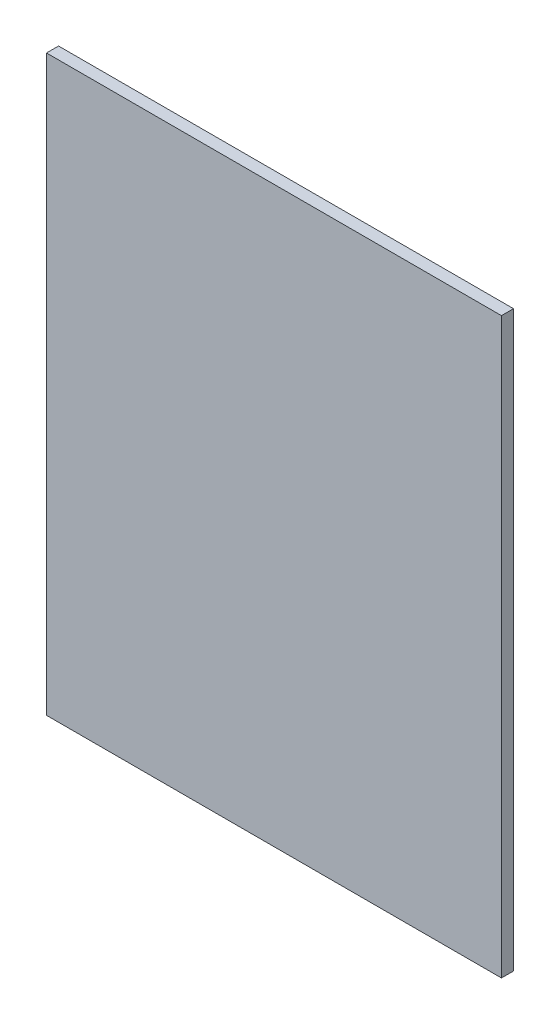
ISO-10303-21;
HEADER;
FILE_DESCRIPTION(('STEP AP214'),'2;1');
FILE_NAME('part.step','',(''),(''),'','','');
FILE_SCHEMA(('AUTOMOTIVE_DESIGN { 1 0 10303 214 1 1 1 1 }'));
ENDSEC;
DATA;
#1=APPLICATION_CONTEXT('core data for automotive mechanical design processes');
#2=APPLICATION_PROTOCOL_DEFINITION('international standard','automotive_design',2000,#1);
#3=PRODUCT_CONTEXT('',#1,'mechanical');
#4=PRODUCT('Part','Part','',(#3));
#5=PRODUCT_RELATED_PRODUCT_CATEGORY('part','',(#4));
#6=PRODUCT_DEFINITION_FORMATION('','',#4);
#7=PRODUCT_DEFINITION_CONTEXT('part definition',#1,'design');
#8=PRODUCT_DEFINITION('design','',#6,#7);
#9=PRODUCT_DEFINITION_SHAPE('','',#8);
#10=(LENGTH_UNIT() NAMED_UNIT(*) SI_UNIT(.MILLI.,.METRE.));
#11=(NAMED_UNIT(*) PLANE_ANGLE_UNIT() SI_UNIT($,.RADIAN.));
#12=(NAMED_UNIT(*) SI_UNIT($,.STERADIAN.) SOLID_ANGLE_UNIT());
#13=UNCERTAINTY_MEASURE_WITH_UNIT(LENGTH_MEASURE(1.E-05),#10,'distance_accuracy_value','');
#14=(GEOMETRIC_REPRESENTATION_CONTEXT(3) GLOBAL_UNCERTAINTY_ASSIGNED_CONTEXT((#13)) GLOBAL_UNIT_ASSIGNED_CONTEXT((#10,
#11,#12)) REPRESENTATION_CONTEXT('',''));
#15=CARTESIAN_POINT('',(0.,0.,0.));
#16=DIRECTION('',(0.,0.,1.));
#17=DIRECTION('',(1.,0.,0.));
#18=AXIS2_PLACEMENT_3D('',#15,#16,#17);
#19=CARTESIAN_POINT('',(6.225,21.225,-0.03048));
#20=DIRECTION('',(0.,-1.,0.));
#21=DIRECTION('',(0.,0.,-1.));
#22=AXIS2_PLACEMENT_3D('',#19,#20,#21);
#23=PLANE('',#22);
#24=DIRECTION('',(1.,0.,0.));
#25=VECTOR('',#24,1.);
#26=CARTESIAN_POINT('',(6.8,21.225,0.));
#27=LINE('',#26,#25);
#28=CARTESIAN_POINT('',(6.225,21.225,0.));
#29=VERTEX_POINT('',#28);
#30=CARTESIAN_POINT('',(7.375,21.225,0.));
#31=VERTEX_POINT('',#30);
#32=EDGE_CURVE('E75',#29,#31,#27,.T.);
#33=ORIENTED_EDGE('',*,*,#32,.T.);
#34=DIRECTION('',(0.,0.,-1.));
#35=VECTOR('',#34,1.);
#36=CARTESIAN_POINT('',(7.375,21.225,-0.01524));
#37=LINE('',#36,#35);
#38=CARTESIAN_POINT('',(7.375,21.225,-0.03048));
#39=VERTEX_POINT('',#38);
#40=EDGE_CURVE('E20',#31,#39,#37,.T.);
#41=ORIENTED_EDGE('',*,*,#40,.T.);
#42=DIRECTION('',(1.,0.,0.));
#43=VECTOR('',#42,1.);
#44=CARTESIAN_POINT('',(6.225,21.225,-0.03048));
#45=LINE('',#44,#43);
#46=CARTESIAN_POINT('',(6.225,21.225,-0.03048));
#47=VERTEX_POINT('',#46);
#48=EDGE_CURVE('E77',#47,#39,#45,.T.);
#49=ORIENTED_EDGE('',*,*,#48,.F.);
#50=DIRECTION('',(0.,0.,-1.));
#51=VECTOR('',#50,1.);
#52=CARTESIAN_POINT('',(6.225,21.225,-0.01524));
#53=LINE('',#52,#51);
#54=EDGE_CURVE('E11',#29,#47,#53,.T.);
#55=ORIENTED_EDGE('',*,*,#54,.F.);
#56=EDGE_LOOP('',(#33,#41,#49,#55));
#57=FACE_BOUND('',#56,.T.);
#58=ADVANCED_FACE('F17',(#57),#23,.F.);
#59=CARTESIAN_POINT('',(6.225,19.775,-0.03048));
#60=DIRECTION('',(1.,0.,0.));
#61=DIRECTION('',(0.,1.,0.));
#62=AXIS2_PLACEMENT_3D('',#59,#60,#61);
#63=PLANE('',#62);
#64=DIRECTION('',(0.,1.,0.));
#65=VECTOR('',#64,1.);
#66=CARTESIAN_POINT('',(6.225,20.5,0.));
#67=LINE('',#66,#65);
#68=CARTESIAN_POINT('',(6.225,19.775,0.));
#69=VERTEX_POINT('',#68);
#70=EDGE_CURVE('E81',#69,#29,#67,.T.);
#71=ORIENTED_EDGE('',*,*,#70,.T.);
#72=ORIENTED_EDGE('',*,*,#54,.T.);
#73=DIRECTION('',(0.,1.,0.));
#74=VECTOR('',#73,1.);
#75=CARTESIAN_POINT('',(6.225,19.775,-0.03048));
#76=LINE('',#75,#74);
#77=CARTESIAN_POINT('',(6.225,19.775,-0.03048));
#78=VERTEX_POINT('',#77);
#79=EDGE_CURVE('E109',#78,#47,#76,.T.);
#80=ORIENTED_EDGE('',*,*,#79,.F.);
#81=DIRECTION('',(0.,0.,-1.));
#82=VECTOR('',#81,1.);
#83=CARTESIAN_POINT('',(6.225,19.775,-0.01524));
#84=LINE('',#83,#82);
#85=EDGE_CURVE('E26',#69,#78,#84,.T.);
#86=ORIENTED_EDGE('',*,*,#85,.F.);
#87=EDGE_LOOP('',(#71,#72,#80,#86));
#88=FACE_BOUND('',#87,.T.);
#89=ADVANCED_FACE('F82',(#88),#63,.F.);
#90=CARTESIAN_POINT('',(7.375,19.775,-0.03048));
#91=DIRECTION('',(0.,1.,0.));
#92=DIRECTION('',(1.,0.,0.));
#93=AXIS2_PLACEMENT_3D('',#90,#91,#92);
#94=PLANE('',#93);
#95=DIRECTION('',(-1.,0.,0.));
#96=VECTOR('',#95,1.);
#97=CARTESIAN_POINT('',(6.8,19.775,0.));
#98=LINE('',#97,#96);
#99=CARTESIAN_POINT('',(7.375,19.775,0.));
#100=VERTEX_POINT('',#99);
#101=EDGE_CURVE('E86',#100,#69,#98,.T.);
#102=ORIENTED_EDGE('',*,*,#101,.T.);
#103=ORIENTED_EDGE('',*,*,#85,.T.);
#104=DIRECTION('',(-1.,0.,0.));
#105=VECTOR('',#104,1.);
#106=CARTESIAN_POINT('',(7.375,19.775,-0.03048));
#107=LINE('',#106,#105);
#108=CARTESIAN_POINT('',(7.375,19.775,-0.03048));
#109=VERTEX_POINT('',#108);
#110=EDGE_CURVE('E105',#109,#78,#107,.T.);
#111=ORIENTED_EDGE('',*,*,#110,.F.);
#112=DIRECTION('',(0.,0.,-1.));
#113=VECTOR('',#112,1.);
#114=CARTESIAN_POINT('',(7.375,19.775,-0.01524));
#115=LINE('',#114,#113);
#116=EDGE_CURVE('E48',#100,#109,#115,.T.);
#117=ORIENTED_EDGE('',*,*,#116,.F.);
#118=EDGE_LOOP('',(#102,#103,#111,#117));
#119=FACE_BOUND('',#118,.T.);
#120=ADVANCED_FACE('F121',(#119),#94,.F.);
#121=CARTESIAN_POINT('',(7.375,21.225,-0.03048));
#122=DIRECTION('',(-1.,0.,0.));
#123=DIRECTION('',(0.,0.,1.));
#124=AXIS2_PLACEMENT_3D('',#121,#122,#123);
#125=PLANE('',#124);
#126=DIRECTION('',(0.,-1.,0.));
#127=VECTOR('',#126,1.);
#128=CARTESIAN_POINT('',(7.375,20.5,0.));
#129=LINE('',#128,#127);
#130=EDGE_CURVE('E90',#31,#100,#129,.T.);
#131=ORIENTED_EDGE('',*,*,#130,.T.);
#132=ORIENTED_EDGE('',*,*,#116,.T.);
#133=DIRECTION('',(0.,-1.,0.));
#134=VECTOR('',#133,1.);
#135=CARTESIAN_POINT('',(7.375,21.225,-0.03048));
#136=LINE('',#135,#134);
#137=EDGE_CURVE('E99',#39,#109,#136,.T.);
#138=ORIENTED_EDGE('',*,*,#137,.F.);
#139=ORIENTED_EDGE('',*,*,#40,.F.);
#140=EDGE_LOOP('',(#131,#132,#138,#139));
#141=FACE_BOUND('',#140,.T.);
#142=ADVANCED_FACE('F118',(#141),#125,.F.);
#143=CARTESIAN_POINT('',(6.8,20.5,-0.03048));
#144=DIRECTION('',(0.,0.,1.));
#145=DIRECTION('',(1.,0.,0.));
#146=AXIS2_PLACEMENT_3D('',#143,#144,#145);
#147=PLANE('',#146);
#148=ORIENTED_EDGE('',*,*,#48,.T.);
#149=ORIENTED_EDGE('',*,*,#137,.T.);
#150=ORIENTED_EDGE('',*,*,#110,.T.);
#151=ORIENTED_EDGE('',*,*,#79,.T.);
#152=EDGE_LOOP('',(#148,#149,#150,#151));
#153=FACE_BOUND('',#152,.T.);
#154=ADVANCED_FACE('F120',(#153),#147,.F.);
#155=CARTESIAN_POINT('',(6.8,20.5,0.));
#156=DIRECTION('',(0.,0.,1.));
#157=DIRECTION('',(1.,0.,0.));
#158=AXIS2_PLACEMENT_3D('',#155,#156,#157);
#159=PLANE('',#158);
#160=ORIENTED_EDGE('',*,*,#32,.F.);
#161=ORIENTED_EDGE('',*,*,#70,.F.);
#162=ORIENTED_EDGE('',*,*,#101,.F.);
#163=ORIENTED_EDGE('',*,*,#130,.F.);
#164=EDGE_LOOP('',(#160,#161,#162,#163));
#165=FACE_BOUND('',#164,.T.);
#166=ADVANCED_FACE('F89',(#165),#159,.T.);
#167=CLOSED_SHELL('',(#58,#89,#120,#142,#154,#166));
#168=MANIFOLD_SOLID_BREP('B1',#167);
#169=ADVANCED_BREP_SHAPE_REPRESENTATION('',(#18,#168),#14);
#170=SHAPE_DEFINITION_REPRESENTATION(#9,#169);
ENDSEC;
END-ISO-10303-21;
